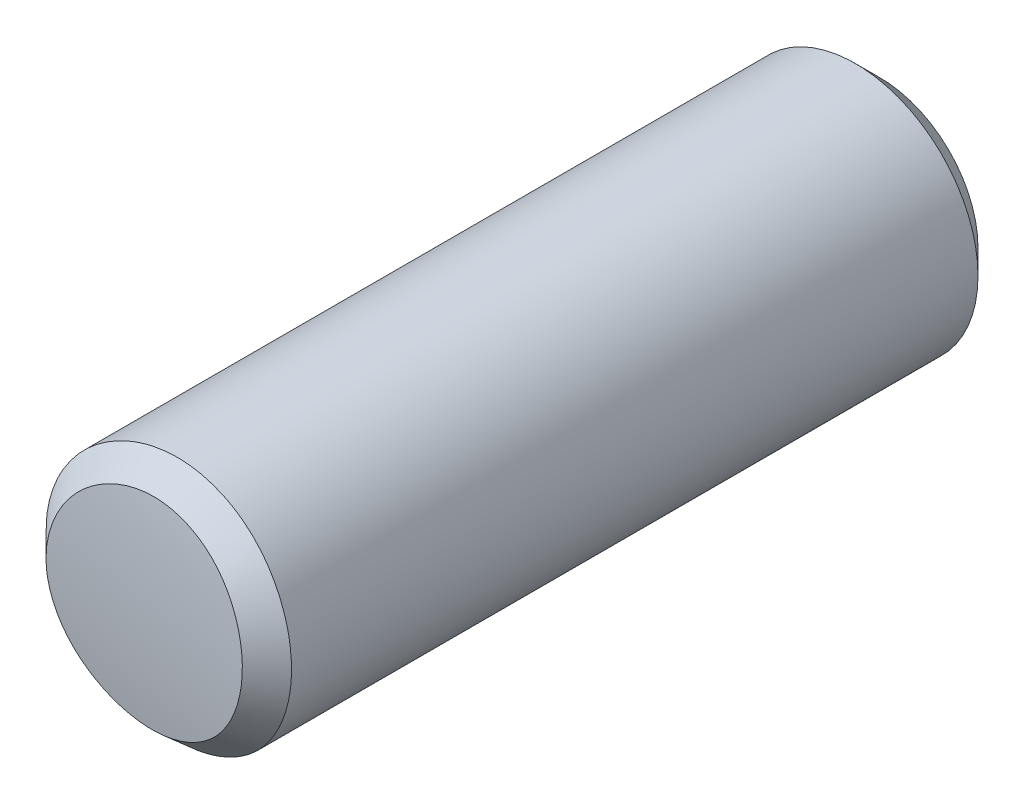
ISO-10303-21;
HEADER;
FILE_DESCRIPTION(('STEP AP214'),'2;1');
FILE_NAME('part.step','',(''),(''),'','','');
FILE_SCHEMA(('AUTOMOTIVE_DESIGN { 1 0 10303 214 1 1 1 1 }'));
ENDSEC;
DATA;
#1=APPLICATION_CONTEXT('core data for automotive mechanical design processes');
#2=APPLICATION_PROTOCOL_DEFINITION('international standard','automotive_design',2000,#1);
#3=PRODUCT_CONTEXT('',#1,'mechanical');
#4=PRODUCT('Part','Part','',(#3));
#5=PRODUCT_RELATED_PRODUCT_CATEGORY('part','',(#4));
#6=PRODUCT_DEFINITION_FORMATION('','',#4);
#7=PRODUCT_DEFINITION_CONTEXT('part definition',#1,'design');
#8=PRODUCT_DEFINITION('design','',#6,#7);
#9=PRODUCT_DEFINITION_SHAPE('','',#8);
#10=(LENGTH_UNIT() NAMED_UNIT(*) SI_UNIT(.MILLI.,.METRE.));
#11=(NAMED_UNIT(*) PLANE_ANGLE_UNIT() SI_UNIT($,.RADIAN.));
#12=(NAMED_UNIT(*) SI_UNIT($,.STERADIAN.) SOLID_ANGLE_UNIT());
#13=UNCERTAINTY_MEASURE_WITH_UNIT(LENGTH_MEASURE(1.E-05),#10,'distance_accuracy_value','');
#14=(GEOMETRIC_REPRESENTATION_CONTEXT(3) GLOBAL_UNCERTAINTY_ASSIGNED_CONTEXT((#13)) GLOBAL_UNIT_ASSIGNED_CONTEXT((#10,
#11,#12)) REPRESENTATION_CONTEXT('',''));
#15=CARTESIAN_POINT('',(0.,0.,0.));
#16=DIRECTION('',(0.,0.,1.));
#17=DIRECTION('',(1.,0.,0.));
#18=AXIS2_PLACEMENT_3D('',#15,#16,#17);
#19=CARTESIAN_POINT('',(-166.142642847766,57.7203263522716,0.));
#20=DIRECTION('',(0.,0.,1.));
#21=DIRECTION('',(1.,0.,0.));
#22=AXIS2_PLACEMENT_3D('',#19,#20,#21);
#23=PLANE('',#22);
#24=CARTESIAN_POINT('',(-166.142642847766,57.7203263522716,0.));
#25=DIRECTION('',(0.,0.,1.));
#26=DIRECTION('',(1.,0.,0.));
#27=AXIS2_PLACEMENT_3D('',#24,#25,#26);
#28=CIRCLE('',#27,1.20000000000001);
#29=CARTESIAN_POINT('',(-164.942642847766,57.7203263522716,0.));
#30=VERTEX_POINT('',#29);
#31=EDGE_CURVE('E11',#30,#30,#28,.F.);
#32=ORIENTED_EDGE('',*,*,#31,.T.);
#33=EDGE_LOOP('',(#32));
#34=FACE_BOUND('',#33,.T.);
#35=ADVANCED_FACE('F365',(#34),#23,.F.);
#36=CARTESIAN_POINT('',(-166.142642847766,57.7203263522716,9.08716702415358));
#37=DIRECTION('',(0.,0.,-1.));
#38=DIRECTION('',(-1.,0.,0.));
#39=AXIS2_PLACEMENT_3D('',#36,#37,#38);
#40=CYLINDRICAL_SURFACE('',#39,1.5);
#41=CARTESIAN_POINT('',(-167.642606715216,57.7307377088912,8.69520940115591));
#42=CARTESIAN_POINT('',(-167.642792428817,57.7061590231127,8.69477166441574));
#43=CARTESIAN_POINT('',(-167.64234770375,57.6815777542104,8.69426581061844));
#44=CARTESIAN_POINT('',(-167.640217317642,57.6324986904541,8.69312849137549));
#45=CARTESIAN_POINT('',(-167.638533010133,57.6080008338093,8.69249716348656));
#46=CARTESIAN_POINT('',(-167.633945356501,57.5591407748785,8.69111901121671));
#47=CARTESIAN_POINT('',(-167.631042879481,57.5347784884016,8.69037226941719));
#48=CARTESIAN_POINT('',(-167.624041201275,57.4862410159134,8.68877344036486));
#49=CARTESIAN_POINT('',(-167.619942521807,57.4620657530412,8.68792139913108));
#50=CARTESIAN_POINT('',(-167.610570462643,57.4139539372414,8.68612208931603));
#51=CARTESIAN_POINT('',(-167.605297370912,57.3900173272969,8.68517484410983));
#52=CARTESIAN_POINT('',(-167.593598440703,57.3424343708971,8.68319523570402));
#53=CARTESIAN_POINT('',(-167.587172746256,57.3187879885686,8.68216288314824));
#54=CARTESIAN_POINT('',(-167.57319046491,57.2718370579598,8.68002315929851));
#55=CARTESIAN_POINT('',(-167.565633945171,57.248532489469,8.6789157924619));
#56=CARTESIAN_POINT('',(-167.549411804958,57.2023167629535,8.67663613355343));
#57=CARTESIAN_POINT('',(-167.540746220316,57.1794055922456,8.67546384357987));
#58=CARTESIAN_POINT('',(-167.522327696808,57.1340282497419,8.67306442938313));
#59=CARTESIAN_POINT('',(-167.512574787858,57.1115620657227,8.67183730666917));
#60=CARTESIAN_POINT('',(-167.492003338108,57.0671262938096,8.66933831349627));
#61=CARTESIAN_POINT('',(-167.481184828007,57.045156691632,8.66806644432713));
#62=CARTESIAN_POINT('',(-167.458503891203,57.001765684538,8.66548805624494));
#63=CARTESIAN_POINT('',(-167.446641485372,56.9803442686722,8.66418153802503));
#64=CARTESIAN_POINT('',(-167.421894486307,56.938101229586,8.66154390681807));
#65=CARTESIAN_POINT('',(-167.409009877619,56.9172796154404,8.66021279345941));
#66=CARTESIAN_POINT('',(-167.38224021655,56.8762877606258,8.65753618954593));
#67=CARTESIAN_POINT('',(-167.368355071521,56.8561175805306,8.65619069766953));
#68=CARTESIAN_POINT('',(-167.339606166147,56.8164801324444,8.65349494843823));
#69=CARTESIAN_POINT('',(-167.324742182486,56.7970130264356,8.65214469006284));
#70=CARTESIAN_POINT('',(-167.294057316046,56.7588332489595,8.64945127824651));
#71=CARTESIAN_POINT('',(-167.278236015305,56.7401209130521,8.64810812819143));
#72=CARTESIAN_POINT('',(-167.245658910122,56.7035019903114,8.64543235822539));
#73=CARTESIAN_POINT('',(-167.228902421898,56.6855960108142,8.64409974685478));
#74=CARTESIAN_POINT('',(-167.194492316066,56.6506589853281,8.64148131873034));
#75=CARTESIAN_POINT('',(-167.176838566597,56.6336280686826,8.6401955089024));
#76=CARTESIAN_POINT('',(-167.140700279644,56.6004837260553,8.63770223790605));
#77=CARTESIAN_POINT('',(-167.122216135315,56.5843698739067,8.63649474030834));
#78=CARTESIAN_POINT('',(-167.084470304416,56.5530827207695,8.63415667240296));
#79=CARTESIAN_POINT('',(-167.065208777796,56.5379092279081,8.63302608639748));
#80=CARTESIAN_POINT('',(-167.025960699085,56.5085260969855,8.63084887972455));
#81=CARTESIAN_POINT('',(-167.005974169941,56.4943164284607,8.62980225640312));
#82=CARTESIAN_POINT('',(-166.965328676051,56.466884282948,8.62779775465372));
#83=CARTESIAN_POINT('',(-166.944669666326,56.453661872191,8.62683988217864));
#84=CARTESIAN_POINT('',(-166.902731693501,56.428227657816,8.62501827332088));
#85=CARTESIAN_POINT('',(-166.881452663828,56.4160159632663,8.62415454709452));
#86=CARTESIAN_POINT('',(-166.838327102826,56.3926266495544,8.6225264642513));
#87=CARTESIAN_POINT('',(-166.816480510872,56.3814491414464,8.62176211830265));
#88=CARTESIAN_POINT('',(-166.772272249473,56.3601517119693,8.62033807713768));
#89=CARTESIAN_POINT('',(-166.749910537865,56.350031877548,8.61967839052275));
#90=CARTESIAN_POINT('',(-166.704724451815,56.3308733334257,8.61846893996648));
#91=CARTESIAN_POINT('',(-166.681900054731,56.3218346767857,8.61791918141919));
#92=CARTESIAN_POINT('',(-166.635841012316,56.3048620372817,8.61693486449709));
#93=CARTESIAN_POINT('',(-166.612606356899,56.2969280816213,8.61650030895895));
#94=CARTESIAN_POINT('',(-166.565779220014,56.2821883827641,8.61575166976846));
#95=CARTESIAN_POINT('',(-166.542186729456,56.2753826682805,8.61543758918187));
#96=CARTESIAN_POINT('',(-166.494696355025,56.2629229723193,8.61493518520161));
#97=CARTESIAN_POINT('',(-166.470798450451,56.2572690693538,8.61474687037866));
#98=CARTESIAN_POINT('',(-166.422749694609,56.2471364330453,8.61450121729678));
#99=CARTESIAN_POINT('',(-166.398598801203,56.2426578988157,8.61444390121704));
#100=CARTESIAN_POINT('',(-166.350096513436,56.2348994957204,8.61446568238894));
#101=CARTESIAN_POINT('',(-166.325745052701,56.2316200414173,8.61454482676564));
#102=CARTESIAN_POINT('',(-166.276894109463,56.2262827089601,8.61484411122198));
#103=CARTESIAN_POINT('',(-166.252394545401,56.2242255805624,8.61506433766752));
#104=CARTESIAN_POINT('',(-166.203299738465,56.2213575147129,8.61565350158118));
#105=CARTESIAN_POINT('',(-166.178704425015,56.2205478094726,8.61602258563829));
#106=CARTESIAN_POINT('',(-166.129507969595,56.220192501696,8.61690473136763));
#107=CARTESIAN_POINT('',(-166.104906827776,56.2206468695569,8.61741778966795));
#108=CARTESIAN_POINT('',(-166.055787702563,56.2227957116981,8.61856802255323));
#109=CARTESIAN_POINT('',(-166.031269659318,56.2244888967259,8.61920506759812));
#110=CARTESIAN_POINT('',(-165.982368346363,56.2290942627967,8.62059545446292));
#111=CARTESIAN_POINT('',(-165.957984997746,56.2320056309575,8.62134871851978));
#112=CARTESIAN_POINT('',(-165.909404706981,56.2390246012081,8.62296059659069));
#113=CARTESIAN_POINT('',(-165.885207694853,56.243131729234,8.623819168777));
#114=CARTESIAN_POINT('',(-165.837051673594,56.2525200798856,8.62563157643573));
#115=CARTESIAN_POINT('',(-165.813092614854,56.2578010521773,8.6265853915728));
#116=CARTESIAN_POINT('',(-165.765464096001,56.269514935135,8.62857798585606));
#117=CARTESIAN_POINT('',(-165.741794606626,56.2759477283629,8.62961675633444));
#118=CARTESIAN_POINT('',(-165.694796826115,56.289943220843,8.63176903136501));
#119=CARTESIAN_POINT('',(-165.67146851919,56.297505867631,8.6328825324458));
#120=CARTESIAN_POINT('',(-165.625204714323,56.3137390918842,8.63517402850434));
#121=CARTESIAN_POINT('',(-165.602269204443,56.3224096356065,8.63635202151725));
#122=CARTESIAN_POINT('',(-165.556842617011,56.3408367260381,8.63876226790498));
#123=CARTESIAN_POINT('',(-165.534351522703,56.3505932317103,8.63999451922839));
#124=CARTESIAN_POINT('',(-165.489865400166,56.3711703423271,8.64250305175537));
#125=CARTESIAN_POINT('',(-165.467870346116,56.3819908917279,8.64377933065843));
#126=CARTESIAN_POINT('',(-165.424427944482,56.4046741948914,8.64636567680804));
#127=CARTESIAN_POINT('',(-165.402980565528,56.4165368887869,8.64767574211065));
#128=CARTESIAN_POINT('',(-165.36068514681,56.4412825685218,8.65031946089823));
#129=CARTESIAN_POINT('',(-165.339837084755,56.454165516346,8.6516531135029));
#130=CARTESIAN_POINT('',(-165.298791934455,56.4809297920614,8.6543336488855));
#131=CARTESIAN_POINT('',(-165.278594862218,56.4948111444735,8.65568053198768));
#132=CARTESIAN_POINT('',(-165.238903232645,56.5235501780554,8.65837775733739));
#133=CARTESIAN_POINT('',(-165.219408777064,56.5384079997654,8.65972810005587));
#134=CARTESIAN_POINT('',(-165.181174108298,56.5690782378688,8.66242028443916));
#135=CARTESIAN_POINT('',(-165.162434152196,56.5848909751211,8.66376212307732));
#136=CARTESIAN_POINT('',(-165.125759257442,56.6174478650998,8.66643352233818));
#137=CARTESIAN_POINT('',(-165.107824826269,56.6341925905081,8.6677630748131));
#138=CARTESIAN_POINT('',(-165.072834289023,56.6685763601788,8.67037413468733));
#139=CARTESIAN_POINT('',(-165.055778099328,56.6862153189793,8.67165564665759));
#140=CARTESIAN_POINT('',(-165.022590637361,56.72232200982,8.67413982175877));
#141=CARTESIAN_POINT('',(-165.006458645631,56.7407890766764,8.67534254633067));
#142=CARTESIAN_POINT('',(-164.97514135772,56.7784986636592,8.67767052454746));
#143=CARTESIAN_POINT('',(-164.959955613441,56.797740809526,8.67879581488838));
#144=CARTESIAN_POINT('',(-164.930553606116,56.8369487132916,8.68096210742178));
#145=CARTESIAN_POINT('',(-164.916337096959,56.8569142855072,8.68200313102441));
#146=CARTESIAN_POINT('',(-164.88889616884,56.897516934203,8.68399626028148));
#147=CARTESIAN_POINT('',(-164.875671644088,56.9181539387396,8.68494837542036));
#148=CARTESIAN_POINT('',(-164.850237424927,56.9600475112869,8.68675846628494));
#149=CARTESIAN_POINT('',(-164.838027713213,56.9813040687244,8.68761644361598));
#150=CARTESIAN_POINT('',(-164.814645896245,57.0243848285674,8.68923319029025));
#151=CARTESIAN_POINT('',(-164.803473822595,57.0462090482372,8.68999195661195));
#152=CARTESIAN_POINT('',(-164.782190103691,57.0903732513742,8.69140516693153));
#153=CARTESIAN_POINT('',(-164.772078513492,57.1127132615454,8.69205960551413));
#154=CARTESIAN_POINT('',(-164.752938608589,57.1578571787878,8.69325905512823));
#155=CARTESIAN_POINT('',(-164.743910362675,57.1806611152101,8.69380405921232));
#156=CARTESIAN_POINT('',(-164.726960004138,57.2266810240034,8.69477952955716));
#157=CARTESIAN_POINT('',(-164.71903798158,57.2498970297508,8.6952099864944));
#158=CARTESIAN_POINT('',(-164.704322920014,57.2966892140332,8.69595125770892));
#159=CARTESIAN_POINT('',(-164.69753001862,57.3202654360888,8.69626205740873));
#160=CARTESIAN_POINT('',(-164.685096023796,57.3677261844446,8.69675889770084));
#161=CARTESIAN_POINT('',(-164.679455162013,57.3916107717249,8.69694491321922));
#162=CARTESIAN_POINT('',(-164.669348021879,57.4396363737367,8.69718712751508));
#163=CARTESIAN_POINT('',(-164.66488213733,57.4637774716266,8.69724328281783));
#164=CARTESIAN_POINT('',(-164.657147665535,57.5122642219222,8.69722052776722));
#165=CARTESIAN_POINT('',(-164.653879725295,57.5366099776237,8.69714154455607));
#166=CARTESIAN_POINT('',(-164.648563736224,57.5854541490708,8.69684401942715));
#167=CARTESIAN_POINT('',(-164.646516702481,57.6099526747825,8.69662536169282));
#168=CARTESIAN_POINT('',(-164.643665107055,57.6590506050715,8.69604122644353));
#169=CARTESIAN_POINT('',(-164.642862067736,57.6836500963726,8.69567556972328));
#170=CARTESIAN_POINT('',(-164.642520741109,57.7328654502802,8.6948011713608));
#171=CARTESIAN_POINT('',(-164.642982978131,57.7574813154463,8.69429237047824));
#172=CARTESIAN_POINT('',(-164.645152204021,57.8066434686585,8.69315036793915));
#173=CARTESIAN_POINT('',(-164.646858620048,57.8311897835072,8.69251722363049));
#174=CARTESIAN_POINT('',(-164.651493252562,57.8801588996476,8.69113458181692));
#175=CARTESIAN_POINT('',(-164.654421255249,57.9045817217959,8.69038510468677));
#176=CARTESIAN_POINT('',(-164.661476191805,57.9532498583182,8.68878060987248));
#177=CARTESIAN_POINT('',(-164.6656031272,57.977495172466,8.68792559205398));
#178=CARTESIAN_POINT('',(-164.675033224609,58.0257543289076,8.68612006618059));
#179=CARTESIAN_POINT('',(-164.680336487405,58.0497681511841,8.68516954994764));
#180=CARTESIAN_POINT('',(-164.692096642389,58.097510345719,8.68318326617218));
#181=CARTESIAN_POINT('',(-164.698553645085,58.1212386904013,8.68214749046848));
#182=CARTESIAN_POINT('',(-164.712598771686,58.1683559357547,8.68000086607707));
#183=CARTESIAN_POINT('',(-164.720186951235,58.1917448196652,8.67889001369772));
#184=CARTESIAN_POINT('',(-164.736471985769,58.238129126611,8.67660342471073));
#185=CARTESIAN_POINT('',(-164.745168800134,58.2611245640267,8.67542769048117));
#186=CARTESIAN_POINT('',(-164.763648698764,58.3066679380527,8.67302152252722));
#187=CARTESIAN_POINT('',(-164.773431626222,58.329215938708,8.67179109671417));
#188=CARTESIAN_POINT('',(-164.79406136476,58.3738103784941,8.66928572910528));
#189=CARTESIAN_POINT('',(-164.804907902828,58.3958569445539,8.66801079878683));
#190=CARTESIAN_POINT('',(-164.827642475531,58.4393944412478,8.6654266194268));
#191=CARTESIAN_POINT('',(-164.839530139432,58.460885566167,8.66411738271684));
#192=CARTESIAN_POINT('',(-164.864324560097,58.5032580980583,8.66147474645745));
#193=CARTESIAN_POINT('',(-164.87723088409,58.524139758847,8.66014135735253));
#194=CARTESIAN_POINT('',(-164.904040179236,58.5652393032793,8.65746073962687));
#195=CARTESIAN_POINT('',(-164.917942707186,58.585457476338,8.65611351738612));
#196=CARTESIAN_POINT('',(-164.946721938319,58.6251759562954,8.65341494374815));
#197=CARTESIAN_POINT('',(-164.961598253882,58.6446765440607,8.65206359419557));
#198=CARTESIAN_POINT('',(-164.992302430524,58.6829060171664,8.64936876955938));
#199=CARTESIAN_POINT('',(-165.008130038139,58.701635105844,8.648025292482));
#200=CARTESIAN_POINT('',(-165.040714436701,58.7382670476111,8.64534966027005));
#201=CARTESIAN_POINT('',(-165.057471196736,58.756169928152,8.64401750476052));
#202=CARTESIAN_POINT('',(-165.091880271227,58.7910878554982,8.6414006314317));
#203=CARTESIAN_POINT('',(-165.109532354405,58.8081031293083,8.64011590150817));
#204=CARTESIAN_POINT('',(-165.145668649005,58.8412141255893,8.63762511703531));
#205=CARTESIAN_POINT('',(-165.164152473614,58.8573102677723,8.63641902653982));
#206=CARTESIAN_POINT('',(-165.201899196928,58.8885595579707,8.63408399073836));
#207=CARTESIAN_POINT('',(-165.221161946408,58.90371288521,8.63295503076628));
#208=CARTESIAN_POINT('',(-165.260413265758,58.9330537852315,8.630781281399));
#209=CARTESIAN_POINT('',(-165.280401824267,58.9472413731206,8.62973649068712));
#210=CARTESIAN_POINT('',(-165.321051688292,58.9746277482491,8.62773582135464));
#211=CARTESIAN_POINT('',(-165.341713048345,58.9878264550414,8.62677994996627));
#212=CARTESIAN_POINT('',(-165.383655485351,59.0132120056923,8.62496247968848));
#213=CARTESIAN_POINT('',(-165.404936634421,59.025398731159,8.62410089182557));
#214=CARTESIAN_POINT('',(-165.448065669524,59.0487371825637,8.62247718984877));
#215=CARTESIAN_POINT('',(-165.469913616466,59.0598887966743,8.62171508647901));
#216=CARTESIAN_POINT('',(-165.514123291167,59.0811338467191,8.62029560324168));
#217=CARTESIAN_POINT('',(-165.536485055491,59.0912272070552,8.61963823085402));
#218=CARTESIAN_POINT('',(-165.581669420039,59.1103325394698,8.6184334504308));
#219=CARTESIAN_POINT('',(-165.604492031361,59.119344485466,8.6178860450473));
#220=CARTESIAN_POINT('',(-165.650545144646,59.1362637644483,8.61690644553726));
#221=CARTESIAN_POINT('',(-165.673775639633,59.1441711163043,8.61647424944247));
#222=CARTESIAN_POINT('',(-165.720591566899,59.1588579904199,8.61573030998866));
#223=CARTESIAN_POINT('',(-165.744176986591,59.1656375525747,8.61541856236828));
#224=CARTESIAN_POINT('',(-165.791649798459,59.1780456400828,8.61492077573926));
#225=CARTESIAN_POINT('',(-165.815537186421,59.1836741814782,8.61473473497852));
#226=CARTESIAN_POINT('',(-165.863560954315,59.1937571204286,8.61449355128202));
#227=CARTESIAN_POINT('',(-165.887697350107,59.1982114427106,8.61443841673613));
#228=CARTESIAN_POINT('',(-165.936166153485,59.2059227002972,8.61446445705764));
#229=CARTESIAN_POINT('',(-165.96049860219,59.209179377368,8.61454566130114));
#230=CARTESIAN_POINT('',(-166.009306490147,59.21447295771,8.61484892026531));
#231=CARTESIAN_POINT('',(-166.033781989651,59.2165093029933,8.61507103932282));
#232=CARTESIAN_POINT('',(-166.082823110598,59.2193371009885,8.61566386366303));
#233=CARTESIAN_POINT('',(-166.107388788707,59.2201275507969,8.61603468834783));
#234=CARTESIAN_POINT('',(-166.156525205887,59.2204490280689,8.61692007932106));
#235=CARTESIAN_POINT('',(-166.181095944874,59.2199800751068,8.61743464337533));
#236=CARTESIAN_POINT('',(-166.230158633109,59.2178092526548,8.61858753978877));
#237=CARTESIAN_POINT('',(-166.254650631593,59.2161084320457,8.61922576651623));
#238=CARTESIAN_POINT('',(-166.303503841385,59.2114930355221,8.62061824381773));
#239=CARTESIAN_POINT('',(-166.327865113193,59.2085790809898,8.62137243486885));
#240=CARTESIAN_POINT('',(-166.376404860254,59.2015592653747,8.62298590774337));
#241=CARTESIAN_POINT('',(-166.400583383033,59.1974537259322,8.62384516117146));
#242=CARTESIAN_POINT('',(-166.448705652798,59.1880717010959,8.62565870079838));
#243=CARTESIAN_POINT('',(-166.47264942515,59.1827953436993,8.62661297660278));
#244=CARTESIAN_POINT('',(-166.520250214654,59.1710927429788,8.62860628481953));
#245=CARTESIAN_POINT('',(-166.543907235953,59.1646665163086,8.62964531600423));
#246=CARTESIAN_POINT('',(-166.590882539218,59.1506851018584,8.63179792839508));
#247=CARTESIAN_POINT('',(-166.614200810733,59.1431298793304,8.6329115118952));
#248=CARTESIAN_POINT('',(-166.660446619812,59.1269113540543,8.63520301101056));
#249=CARTESIAN_POINT('',(-166.683374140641,59.1182480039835,8.636380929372));
#250=CARTESIAN_POINT('',(-166.728786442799,59.0998340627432,8.63879088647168));
#251=CARTESIAN_POINT('',(-166.751271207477,59.0900834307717,8.6400229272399));
#252=CARTESIAN_POINT('',(-166.795745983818,59.0695157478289,8.64253092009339));
#253=CARTESIAN_POINT('',(-166.817735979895,59.0586986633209,8.64380687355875));
#254=CARTESIAN_POINT('',(-166.861169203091,59.0360188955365,8.64639247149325));
#255=CARTESIAN_POINT('',(-166.882612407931,59.0241561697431,8.64770211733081));
#256=CARTESIAN_POINT('',(-166.924900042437,58.9994059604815,8.65034492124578));
#257=CARTESIAN_POINT('',(-166.945744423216,58.9865183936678,8.65167808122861));
#258=CARTESIAN_POINT('',(-166.986782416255,58.9597393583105,8.65435757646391));
#259=CARTESIAN_POINT('',(-167.006975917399,58.9458477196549,8.65570391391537));
#260=CARTESIAN_POINT('',(-167.046660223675,58.9170815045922,8.65840001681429));
#261=CARTESIAN_POINT('',(-167.066150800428,58.9022066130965,8.65974978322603));
#262=CARTESIAN_POINT('',(-167.104377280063,58.871494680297,8.66244079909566));
#263=CARTESIAN_POINT('',(-167.12311275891,58.8556571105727,8.66378204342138));
#264=CARTESIAN_POINT('',(-167.159777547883,58.8230415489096,8.66645229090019));
#265=CARTESIAN_POINT('',(-167.177706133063,58.806262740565,8.66778128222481));
#266=CARTESIAN_POINT('',(-167.212683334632,58.7718038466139,8.67039104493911));
#267=CARTESIAN_POINT('',(-167.229731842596,58.7541236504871,8.67167181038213));
#268=CARTESIAN_POINT('',(-167.262902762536,58.7179312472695,8.67415416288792));
#269=CARTESIAN_POINT('',(-167.279025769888,58.6994195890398,8.67535580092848));
#270=CARTESIAN_POINT('',(-167.310323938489,58.6616182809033,8.67768136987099));
#271=CARTESIAN_POINT('',(-167.325499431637,58.6423289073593,8.67880532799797));
#272=CARTESIAN_POINT('',(-167.354880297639,58.6030251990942,8.68096877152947));
#273=CARTESIAN_POINT('',(-167.36908581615,58.5830109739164,8.68200826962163));
#274=CARTESIAN_POINT('',(-167.396504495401,58.5423107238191,8.68399822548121));
#275=CARTESIAN_POINT('',(-167.409717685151,58.5216247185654,8.68494868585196));
#276=CARTESIAN_POINT('',(-167.435129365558,58.4796339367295,8.686755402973));
#277=CARTESIAN_POINT('',(-167.447327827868,58.458329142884,8.6876116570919));
#278=CARTESIAN_POINT('',(-167.470687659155,58.4151537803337,8.68922495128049));
#279=CARTESIAN_POINT('',(-167.481848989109,58.3932831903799,8.68998198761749));
#280=CARTESIAN_POINT('',(-167.503112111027,58.3490291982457,8.69139178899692));
#281=CARTESIAN_POINT('',(-167.513213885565,58.3266457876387,8.69204455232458));
#282=CARTESIAN_POINT('',(-167.532335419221,58.2814191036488,8.69324075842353));
#283=CARTESIAN_POINT('',(-167.541355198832,58.2585758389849,8.69378420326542));
#284=CARTESIAN_POINT('',(-167.55829024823,58.2124823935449,8.69475671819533));
#285=CARTESIAN_POINT('',(-167.566205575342,58.1892322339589,8.6951857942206));
#286=CARTESIAN_POINT('',(-167.58090922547,58.1423779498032,8.69592451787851));
#287=CARTESIAN_POINT('',(-167.587697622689,58.118773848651,8.69623417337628));
#288=CARTESIAN_POINT('',(-167.600124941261,58.0712646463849,8.69672900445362));
#289=CARTESIAN_POINT('',(-167.605763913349,58.0473595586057,8.69691418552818));
#290=CARTESIAN_POINT('',(-167.615869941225,57.9993013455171,8.69715501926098));
#291=CARTESIAN_POINT('',(-167.620336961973,57.9751482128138,8.69721066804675));
#292=CARTESIAN_POINT('',(-167.628076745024,57.9266469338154,8.69718740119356));
#293=CARTESIAN_POINT('',(-167.631349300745,57.9022987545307,8.69710846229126));
#294=CARTESIAN_POINT('',(-167.636677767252,57.8534602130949,8.69681097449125));
#295=CARTESIAN_POINT('',(-167.638733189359,57.8289697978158,8.69659236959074));
#296=CARTESIAN_POINT('',(-167.64160560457,57.7799003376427,8.69601059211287));
#297=CARTESIAN_POINT('',(-167.642421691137,57.7553212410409,8.6956473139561));
#298=CARTESIAN_POINT('',(-167.642606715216,57.7307377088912,8.69520940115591));
#299=B_SPLINE_CURVE_WITH_KNOTS('',3,(#41,#42,#43,#44,#45,#46,#47,#48,#49,#50,#51,#52,#53,#54,
#55,#56,#57,#58,#59,#60,#61,#62,#63,#64,#65,#66,#67,#68,#69,#70,#71,#72,#73,#74,#75,#76,#77,#78,
#79,#80,#81,#82,#83,#84,#85,#86,#87,#88,#89,#90,#91,#92,#93,#94,#95,#96,#97,#98,#99,#100,#101,
#102,#103,#104,#105,#106,#107,#108,#109,#110,#111,#112,#113,#114,#115,#116,#117,#118,#119,#120,
#121,#122,#123,#124,#125,#126,#127,#128,#129,#130,#131,#132,#133,#134,#135,#136,#137,#138,#139,
#140,#141,#142,#143,#144,#145,#146,#147,#148,#149,#150,#151,#152,#153,#154,#155,#156,#157,#158,
#159,#160,#161,#162,#163,#164,#165,#166,#167,#168,#169,#170,#171,#172,#173,#174,#175,#176,#177,
#178,#179,#180,#181,#182,#183,#184,#185,#186,#187,#188,#189,#190,#191,#192,#193,#194,#195,#196,
#197,#198,#199,#200,#201,#202,#203,#204,#205,#206,#207,#208,#209,#210,#211,#212,#213,#214,#215,
#216,#217,#218,#219,#220,#221,#222,#223,#224,#225,#226,#227,#228,#229,#230,#231,#232,#233,#234,
#235,#236,#237,#238,#239,#240,#241,#242,#243,#244,#245,#246,#247,#248,#249,#250,#251,#252,#253,
#254,#255,#256,#257,#258,#259,#260,#261,#262,#263,#264,#265,#266,#267,#268,#269,#270,#271,#272,
#273,#274,#275,#276,#277,#278,#279,#280,#281,#282,#283,#284,#285,#286,#287,#288,#289,#290,#291,
#292,#293,#294,#295,#296,#297,#298),.UNSPECIFIED.,.F.,.F.,(4,2,2,2,2,2,2,2,2,2,2,2,2,2,2,2,2,2,
2,2,2,2,2,2,2,2,2,2,2,2,2,2,2,2,2,2,2,2,2,2,2,2,2,2,2,2,2,2,2,2,2,2,2,2,2,2,2,2,2,2,2,2,2,2,2,2,
2,2,2,2,2,2,2,2,2,2,2,2,2,2,2,2,2,2,2,2,2,2,2,2,2,2,2,2,2,2,2,2,2,2,2,2,2,2,2,2,2,2,2,2,2,2,2,2,
2,2,2,2,2,2,2,2,2,2,2,2,2,2,4),(0.,0.0737402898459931,0.14740018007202,0.221007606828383,
0.294582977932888,0.368140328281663,0.441688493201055,0.515232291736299,0.588773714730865,
0.6623131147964,0.735850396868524,0.8093862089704,0.882923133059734,0.956466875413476,
1.03002745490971,1.10362038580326,1.17726784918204,1.25092616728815,1.32454997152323,
1.39815870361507,1.47176510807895,1.54537644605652,1.61899571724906,1.69262288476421,
1.76625610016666,1.8398929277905,1.91353156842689,1.98717208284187,2.06081761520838,
2.13447561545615,2.20815905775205,2.2818876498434,2.35568902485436,2.42948867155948,
2.50321162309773,2.57688545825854,2.65053012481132,2.72415910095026,2.79778057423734,
2.87139863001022,2.94501444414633,3.01862747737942,3.0922366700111,3.16584163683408,
3.23944386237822,3.31304789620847,3.38666254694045,3.46030207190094,3.53398735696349,
3.60766561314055,3.68128571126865,3.75487067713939,3.82843688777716,3.90199524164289,
3.9755523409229,4.04911167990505,4.12267483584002,4.19624266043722,4.26981647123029,
4.34339924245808,4.4169967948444,4.49061898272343,4.56428087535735,4.63800392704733,
4.71181712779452,4.78566092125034,4.85947073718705,4.93326764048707,5.00706463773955,
5.08086796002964,5.15467835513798,5.22849238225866,5.30230370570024,5.37610438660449,
5.44988617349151,5.52364179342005,5.59736624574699,5.67105809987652,5.74472079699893,
5.81836395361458,5.89200466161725,5.96562644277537,6.03921433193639,6.11278818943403,
6.18636089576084,6.25993958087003,6.33352686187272,6.4071220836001,6.48072255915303,
6.55432480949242,6.62792580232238,6.70152419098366,6.77512155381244,6.84872363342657,
6.92234157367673,6.99599314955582,7.06970398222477,7.14341366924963,7.21706066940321,
7.29066999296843,7.36425946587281,7.43784089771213,7.51142126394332,7.58500389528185,
7.65858967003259,7.73217820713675,7.80576905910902,7.87936290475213,7.95296274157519,
8.0265750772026,8.10021111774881,8.17388794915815,8.24762970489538,8.32138052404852,
8.39508335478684,8.46876022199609,8.54242600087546,8.61608962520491,8.68975530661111,
8.76342375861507,8.83709342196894,8.91076168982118,8.98442613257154,9.05808572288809,
9.13174206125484,9.20540060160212,9.27907187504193,9.35277270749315,9.42652742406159),.UNSPECIFIED.);
#300=CARTESIAN_POINT('',(-167.642606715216,57.7307377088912,8.69520940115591));
#301=VERTEX_POINT('',#300);
#302=EDGE_CURVE('E377',#301,#301,#299,.F.);
#303=ORIENTED_EDGE('',*,*,#302,.T.);
#304=EDGE_LOOP('',(#303));
#305=FACE_BOUND('',#304,.T.);
#306=CARTESIAN_POINT('',(-166.142642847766,57.7203263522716,0.299999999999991));
#307=DIRECTION('',(0.,0.,1.));
#308=DIRECTION('',(1.,0.,0.));
#309=AXIS2_PLACEMENT_3D('',#306,#307,#308);
#310=CIRCLE('',#309,1.5);
#311=CARTESIAN_POINT('',(-164.642642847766,57.7203263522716,0.299999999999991));
#312=VERTEX_POINT('',#311);
#313=EDGE_CURVE('E382',#312,#312,#310,.T.);
#314=ORIENTED_EDGE('',*,*,#313,.T.);
#315=EDGE_LOOP('',(#314));
#316=FACE_BOUND('',#315,.T.);
#317=ADVANCED_FACE('F367',(#305,#316),#40,.T.);
#318=CARTESIAN_POINT('',(-260.848394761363,73.8677935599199,-1.51575044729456E-10));
#319=DIRECTION('',(-0.985774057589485,0.168075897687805,4.90529493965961E-12));
#320=DIRECTION('',(4.84931741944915E-12,-7.43736577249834E-13,1.));
#321=AXIS2_PLACEMENT_3D('',#318,#319,#320);
#322=CYLINDRICAL_SURFACE('',#321,9.);
#323=CARTESIAN_POINT('',(-167.342762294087,57.7220174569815,8.99777652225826));
#324=CARTESIAN_POINT('',(-167.338574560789,58.047231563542,9.00502975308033));
#325=CARTESIAN_POINT('',(-167.205176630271,58.3694211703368,8.99245125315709));
#326=CARTESIAN_POINT('',(-166.754615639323,58.8278356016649,8.94903713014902));
#327=CARTESIAN_POINT('',(-166.441869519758,58.9601940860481,8.92367421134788));
#328=CARTESIAN_POINT('',(-165.812491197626,58.9596167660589,8.90893553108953));
#329=CARTESIAN_POINT('',(-165.502294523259,58.8252889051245,8.92168606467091));
#330=CARTESIAN_POINT('',(-165.06425945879,58.3660549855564,8.96521225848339));
#331=CARTESIAN_POINT('',(-164.938540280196,58.0428204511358,8.99053297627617));
#332=CARTESIAN_POINT('',(-164.946541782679,57.3917025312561,9.00508021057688));
#333=CARTESIAN_POINT('',(-165.080221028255,57.070528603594,8.99244272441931));
#334=CARTESIAN_POINT('',(-165.53093900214,56.6131326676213,8.94900961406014));
#335=CARTESIAN_POINT('',(-165.843622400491,56.4802290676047,8.92363322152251));
#336=CARTESIAN_POINT('',(-166.473832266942,56.4812678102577,8.9089481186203));
#337=CARTESIAN_POINT('',(-166.783816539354,56.6160924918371,8.92175441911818));
#338=CARTESIAN_POINT('',(-167.221936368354,57.0756889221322,8.96531305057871));
#339=CARTESIAN_POINT('',(-167.346950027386,57.3968033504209,8.99052329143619));
#340=CARTESIAN_POINT('',(-167.342762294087,57.7220174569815,8.99777652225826));
#341=B_SPLINE_CURVE_WITH_KNOTS('',3,(#323,#324,#325,#326,#327,#328,#329,#330,#331,#332,#333,
#334,#335,#336,#337,#338,#339,#340),.UNSPECIFIED.,.T.,.F.,(4,2,2,2,2,2,2,2,4),
(0.00028511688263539,0.00122311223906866,0.00216110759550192,0.00309910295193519,
0.00403709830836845,0.00497509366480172,0.00591308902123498,0.00685108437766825,
0.00778907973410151),.UNSPECIFIED.);
#342=CARTESIAN_POINT('',(-167.342762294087,57.7220174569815,8.99777652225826));
#343=VERTEX_POINT('',#342);
#344=EDGE_CURVE('E373',#343,#343,#341,.F.);
#345=ORIENTED_EDGE('',*,*,#344,.T.);
#346=EDGE_LOOP('',(#345));
#347=FACE_BOUND('',#346,.T.);
#348=ADVANCED_FACE('F406',(#347),#322,.T.);
#349=CARTESIAN_POINT('',(-167.642606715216,57.7307377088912,8.69520940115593));
#350=CARTESIAN_POINT('',(-167.639639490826,58.1242645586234,8.7022187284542));
#351=CARTESIAN_POINT('',(-167.475159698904,58.5132307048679,8.69006320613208));
#352=CARTESIAN_POINT('',(-166.915227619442,59.0648379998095,8.64810896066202));
#353=CARTESIAN_POINT('',(-166.525268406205,59.2228310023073,8.62359890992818));
#354=CARTESIAN_POINT('',(-165.738645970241,59.2177455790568,8.60935586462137));
#355=CARTESIAN_POINT('',(-165.350014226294,59.0530273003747,8.62167763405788));
#356=CARTESIAN_POINT('',(-164.799341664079,58.4942349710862,8.66374016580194));
#357=CARTESIAN_POINT('',(-164.639960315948,58.1021981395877,8.68820943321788));
#358=CARTESIAN_POINT('',(-164.645422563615,57.3143072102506,8.70226748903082));
#359=CARTESIAN_POINT('',(-164.810261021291,56.9265721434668,8.69005496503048));
#360=CARTESIAN_POINT('',(-165.370396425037,56.376198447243,8.64808236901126));
#361=CARTESIAN_POINT('',(-165.760273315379,56.2175453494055,8.62355930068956));
#362=CARTESIAN_POINT('',(-166.547938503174,56.2231949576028,8.60936802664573));
#363=CARTESIAN_POINT('',(-166.936308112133,56.3885129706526,8.62174368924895));
#364=CARTESIAN_POINT('',(-167.487089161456,56.9477445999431,8.663837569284));
#365=CARTESIAN_POINT('',(-167.645573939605,57.3372108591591,8.68820007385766));
#366=CARTESIAN_POINT('',(-167.642606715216,57.7307377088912,8.69520940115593));
#367=CARTESIAN_POINT('',(-167.342762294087,57.7220174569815,8.99777652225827));
#368=CARTESIAN_POINT('',(-167.338574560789,58.047231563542,9.00502975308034));
#369=CARTESIAN_POINT('',(-167.205176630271,58.3694211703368,8.99245125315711));
#370=CARTESIAN_POINT('',(-166.754615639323,58.8278356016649,8.94903713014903));
#371=CARTESIAN_POINT('',(-166.441869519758,58.960194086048,8.9236742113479));
#372=CARTESIAN_POINT('',(-165.812491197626,58.9596167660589,8.90893553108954));
#373=CARTESIAN_POINT('',(-165.502294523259,58.8252889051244,8.92168606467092));
#374=CARTESIAN_POINT('',(-165.06425945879,58.3660549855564,8.9652122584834));
#375=CARTESIAN_POINT('',(-164.938540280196,58.0428204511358,8.99053297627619));
#376=CARTESIAN_POINT('',(-164.946541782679,57.3917025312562,9.0050802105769));
#377=CARTESIAN_POINT('',(-165.080221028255,57.070528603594,8.99244272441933));
#378=CARTESIAN_POINT('',(-165.53093900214,56.6131326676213,8.94900961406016));
#379=CARTESIAN_POINT('',(-165.843622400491,56.4802290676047,8.92363322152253));
#380=CARTESIAN_POINT('',(-166.473832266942,56.4812678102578,8.90894811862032));
#381=CARTESIAN_POINT('',(-166.783816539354,56.6160924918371,8.92175441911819));
#382=CARTESIAN_POINT('',(-167.221936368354,57.0756889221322,8.96531305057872));
#383=CARTESIAN_POINT('',(-167.346950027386,57.3968033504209,8.9905232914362));
#384=CARTESIAN_POINT('',(-167.342762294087,57.7220174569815,8.99777652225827));
#385=B_SPLINE_SURFACE_WITH_KNOTS('',1,3,((#349,#350,#351,#352,#353,#354,#355,#356,#357,#358,
#359,#360,#361,#362,#363,#364,#365,#366),(#367,#368,#369,#370,#371,#372,#373,#374,#375,#376,
#377,#378,#379,#380,#381,#382,#383,#384)),.UNSPECIFIED.,.F.,.T.,.F.,(2,2),(4,2,2,2,2,2,2,2,4),
(0.,1.),(0.00028511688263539,0.00122311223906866,0.00216110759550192,0.00309910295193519,
0.00403709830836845,0.00497509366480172,0.00591308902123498,0.00685108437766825,
0.00778907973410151),.UNSPECIFIED.);
#386=ORIENTED_EDGE('',*,*,#344,.F.);
#387=EDGE_LOOP('',(#386));
#388=FACE_BOUND('',#387,.T.);
#389=ORIENTED_EDGE('',*,*,#302,.F.);
#390=EDGE_LOOP('',(#389));
#391=FACE_BOUND('',#390,.T.);
#392=ADVANCED_FACE('F414',(#388,#391),#385,.T.);
#393=CARTESIAN_POINT('',(-166.142642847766,57.7203263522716,0.299999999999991));
#394=DIRECTION('',(0.,0.,1.));
#395=DIRECTION('',(1.,0.,0.));
#396=AXIS2_PLACEMENT_3D('',#393,#394,#395);
#397=CONICAL_SURFACE('',#396,1.5,0.785398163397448);
#398=ORIENTED_EDGE('',*,*,#31,.F.);
#399=EDGE_LOOP('',(#398));
#400=FACE_BOUND('',#399,.T.);
#401=ORIENTED_EDGE('',*,*,#313,.F.);
#402=EDGE_LOOP('',(#401));
#403=FACE_BOUND('',#402,.T.);
#404=ADVANCED_FACE('F435',(#400,#403),#397,.T.);
#405=CLOSED_SHELL('',(#35,#317,#348,#392,#404));
#406=MANIFOLD_SOLID_BREP('B2',#405);
#407=ADVANCED_BREP_SHAPE_REPRESENTATION('',(#18,#406),#14);
#408=SHAPE_DEFINITION_REPRESENTATION(#9,#407);
ENDSEC;
END-ISO-10303-21;
